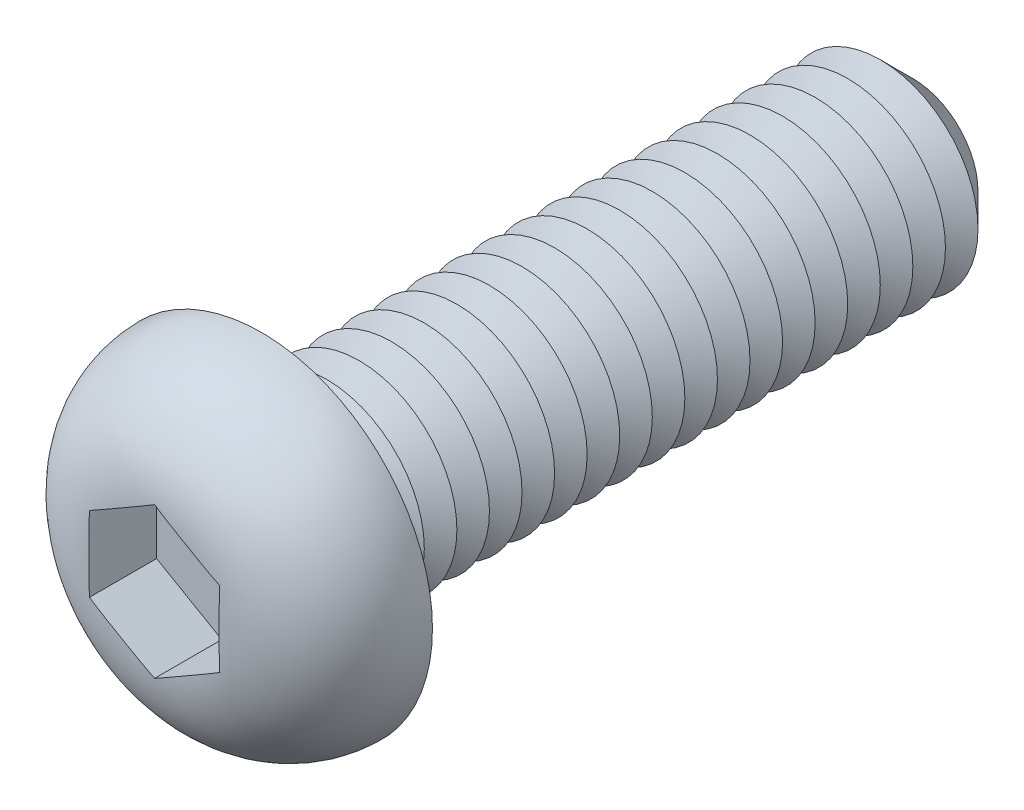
from build123d import *

# Parameters (mm, degrees)
CUT_EXTRUDE1_DEPTH  = 2.08
SKETCH4_R           = 3
BOSS_EXTRUDE1_DEPTH = 20
CHAMFER1_SIZE       = 1
LPATTERN1_COUNT     = 18
LPATTERN1_PITCH     = 1
FILLET2_R           = 0.5
SKETCH6_R           = 0.8
CUT_EXTRUDE2_DEPTH  = 21.22


with BuildPart() as part:
    # Sketch2 → Revolve1 (revolve)
    with BuildSketch(Plane(origin=(0, 0, 0), x_dir=(0, 0, -1), z_dir=(1, 0, 0)), mode=Mode.PRIVATE) as revolve1_sk:
        with BuildLine():
            Line((0, 0), (-3.3, 0))
            Line((-3.3, 0), (-3.3, 1.95))
            ThreePointArc((-3.3, 1.95), (-2.333452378, 4.283452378), (0, 5.25))
            Line((0, 5.25), (0, 0))
        make_face()
    revolve(revolve1_sk.sketch.rotate(Axis((0, 0, 47.934239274), (0, 0, -1)), 90), axis=Axis((0, 0, 47.934239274), (0, 0, -1)))

    # Sketch3 → Cut-Extrude1 (cut)
    with BuildSketch(Plane.XY.offset(3.3)):
        Polygon((0, 2.309401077), (-2, 1.154700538), (-2, -1.154700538), (0, -2.309401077), (2, -1.154700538), (2, 1.154700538), align=None)
    extrude(amount=-CUT_EXTRUDE1_DEPTH, mode=Mode.SUBTRACT)

    # Sketch4 → Boss-Extrude1 (add)
    with BuildSketch(Plane(origin=(0, 0, 0), x_dir=(-1, 0, 0), z_dir=(0, 0, -1))):
        with Locations(Location((0, 0, 0), (0, 0, 180))):
            Circle(SKETCH4_R)
    extrude(amount=BOSS_EXTRUDE1_DEPTH)

    # Chamfer1
    chamfer1_edges = [part.edges().sort_by_distance(p)[0] for p in [
        (-3, 0, -20),
    ]]
    chamfer(chamfer1_edges, length=CHAMFER1_SIZE)

    # Sketch5 → Cut-Revolve1 (revolve, cut)
    with BuildSketch(Plane(origin=(0, 0, 0), x_dir=(0, 0, -1), z_dir=(1, 0, 0)), mode=Mode.PRIVATE) as cut_revolve1_sk:
        Polygon((1, 3), (2, 3), (1.5, 2.133974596), align=None)
    cut_revolve1 = revolve(cut_revolve1_sk.sketch.rotate(Axis((0, 0, 47.934239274), (0, 0, -1)), 90), axis=Axis((0, 0, 47.934239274), (0, 0, -1)), mode=Mode.SUBTRACT)

    # LPattern1: Cut-Revolve1 ×18
    with Locations(*[(0, 0, -i * LPATTERN1_PITCH) for i in range(1, LPATTERN1_COUNT)]):
        add(cut_revolve1, mode=Mode.SUBTRACT)

    # Fillet2
    fillet2_edges = [part.edges().sort_by_distance(p)[0] for p in [
        (-3, 0, 0),
    ]]
    fillet(fillet2_edges, radius=FILLET2_R)

    # Sketch6 → Cut-Extrude2 (cut)
    with BuildSketch(Plane.XY.offset(1.22)):
        Circle(SKETCH6_R)
    extrude(amount=-CUT_EXTRUDE2_DEPTH, mode=Mode.SUBTRACT)


solid = part.part
